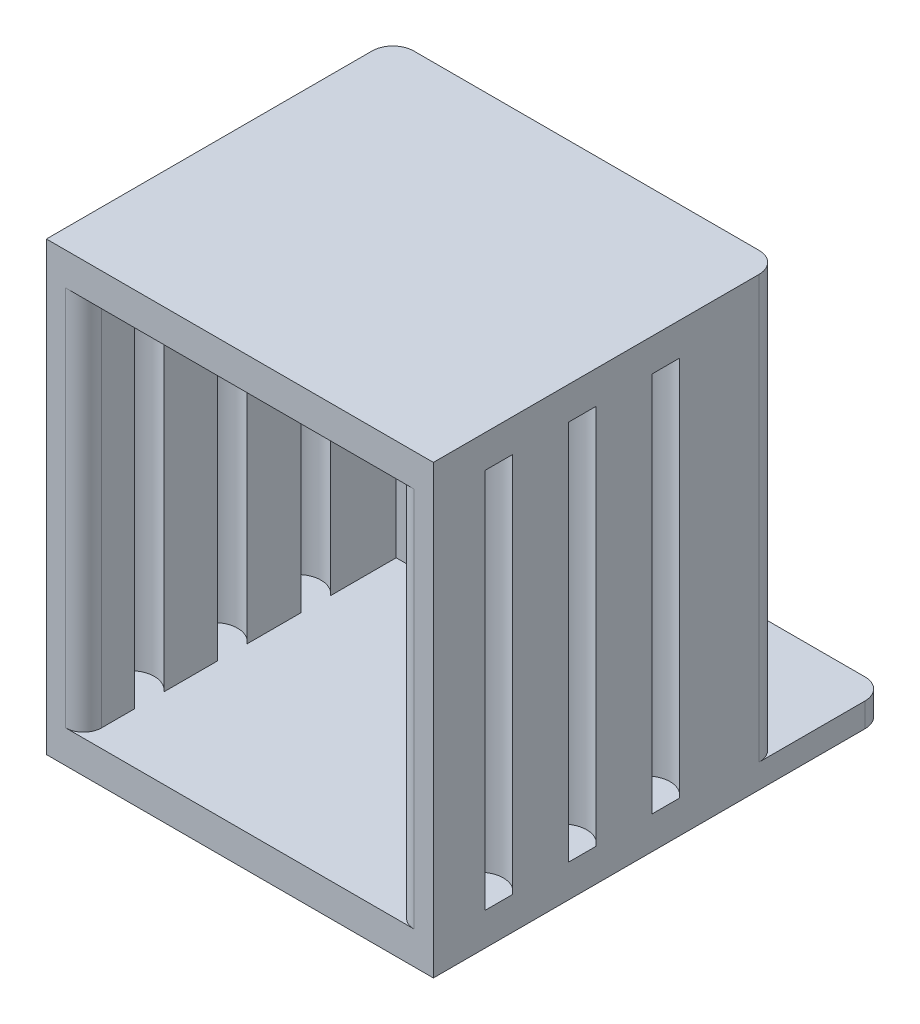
ISO-10303-21;
HEADER;
FILE_DESCRIPTION(('STEP AP214'),'2;1');
FILE_NAME('part.step','',(''),(''),'','','');
FILE_SCHEMA(('AUTOMOTIVE_DESIGN { 1 0 10303 214 1 1 1 1 }'));
ENDSEC;
DATA;
#1=APPLICATION_CONTEXT('core data for automotive mechanical design processes');
#2=APPLICATION_PROTOCOL_DEFINITION('international standard','automotive_design',2000,#1);
#3=PRODUCT_CONTEXT('',#1,'mechanical');
#4=PRODUCT('Part','Part','',(#3));
#5=PRODUCT_RELATED_PRODUCT_CATEGORY('part','',(#4));
#6=PRODUCT_DEFINITION_FORMATION('','',#4);
#7=PRODUCT_DEFINITION_CONTEXT('part definition',#1,'design');
#8=PRODUCT_DEFINITION('design','',#6,#7);
#9=PRODUCT_DEFINITION_SHAPE('','',#8);
#10=(LENGTH_UNIT() NAMED_UNIT(*) SI_UNIT(.MILLI.,.METRE.));
#11=(NAMED_UNIT(*) PLANE_ANGLE_UNIT() SI_UNIT($,.RADIAN.));
#12=(NAMED_UNIT(*) SI_UNIT($,.STERADIAN.) SOLID_ANGLE_UNIT());
#13=UNCERTAINTY_MEASURE_WITH_UNIT(LENGTH_MEASURE(1.E-05),#10,'distance_accuracy_value','');
#14=(GEOMETRIC_REPRESENTATION_CONTEXT(3) GLOBAL_UNCERTAINTY_ASSIGNED_CONTEXT((#13)) GLOBAL_UNIT_ASSIGNED_CONTEXT((#10,
#11,#12)) REPRESENTATION_CONTEXT('',''));
#15=CARTESIAN_POINT('',(0.,0.,0.));
#16=DIRECTION('',(0.,0.,1.));
#17=DIRECTION('',(1.,0.,0.));
#18=AXIS2_PLACEMENT_3D('',#15,#16,#17);
#19=CARTESIAN_POINT('',(-16.51,38.1,0.));
#20=DIRECTION('',(1.,0.,0.));
#21=DIRECTION('',(0.,0.,-1.));
#22=AXIS2_PLACEMENT_3D('',#19,#20,#21);
#23=PLANE('',#22);
#24=DIRECTION('',(0.,0.,1.));
#25=VECTOR('',#24,1.);
#26=CARTESIAN_POINT('',(-16.51,2.794,0.));
#27=LINE('',#26,#25);
#28=CARTESIAN_POINT('',(-16.51,2.794,-13.8743208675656));
#29=VERTEX_POINT('',#28);
#30=CARTESIAN_POINT('',(-16.51,2.794,-11.5256791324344));
#31=VERTEX_POINT('',#30);
#32=EDGE_CURVE('E339',#29,#31,#27,.T.);
#33=ORIENTED_EDGE('',*,*,#32,.F.);
#34=DIRECTION('',(0.,1.,0.));
#35=VECTOR('',#34,1.);
#36=CARTESIAN_POINT('',(-16.51,2.794,-13.8743208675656));
#37=LINE('',#36,#35);
#38=CARTESIAN_POINT('',(-16.51,35.306,-13.8743208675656));
#39=VERTEX_POINT('',#38);
#40=EDGE_CURVE('E334',#39,#29,#37,.F.);
#41=ORIENTED_EDGE('',*,*,#40,.F.);
#42=DIRECTION('',(0.,0.,1.));
#43=VECTOR('',#42,1.);
#44=CARTESIAN_POINT('',(-16.51,35.306,0.));
#45=LINE('',#44,#43);
#46=CARTESIAN_POINT('',(-16.51,35.306,-11.5256791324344));
#47=VERTEX_POINT('',#46);
#48=EDGE_CURVE('E336',#39,#47,#45,.T.);
#49=ORIENTED_EDGE('',*,*,#48,.T.);
#50=DIRECTION('',(0.,1.,0.));
#51=VECTOR('',#50,1.);
#52=CARTESIAN_POINT('',(-16.51,2.794,-11.5256791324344));
#53=LINE('',#52,#51);
#54=EDGE_CURVE('E331',#31,#47,#53,.T.);
#55=ORIENTED_EDGE('',*,*,#54,.F.);
#56=EDGE_LOOP('',(#33,#41,#49,#55));
#57=FACE_BOUND('',#56,.T.);
#58=DIRECTION('',(0.,0.,-1.));
#59=VECTOR('',#58,1.);
#60=CARTESIAN_POINT('',(-16.51,2.0574,-38.608));
#61=LINE('',#60,#59);
#62=CARTESIAN_POINT('',(-16.51,2.0574,-27.7876));
#63=VERTEX_POINT('',#62);
#64=CARTESIAN_POINT('',(-16.51,2.0574,-36.83));
#65=VERTEX_POINT('',#64);
#66=EDGE_CURVE('E443',#63,#65,#61,.T.);
#67=ORIENTED_EDGE('',*,*,#66,.T.);
#68=DIRECTION('',(0.,-1.,0.));
#69=VECTOR('',#68,1.);
#70=CARTESIAN_POINT('',(-16.51,0.,-36.83));
#71=LINE('',#70,#69);
#72=CARTESIAN_POINT('',(-16.51,0.,-36.83));
#73=VERTEX_POINT('',#72);
#74=EDGE_CURVE('E471',#65,#73,#71,.T.);
#75=ORIENTED_EDGE('',*,*,#74,.T.);
#76=DIRECTION('',(0.,0.,1.));
#77=VECTOR('',#76,1.);
#78=CARTESIAN_POINT('',(-16.51,0.,0.));
#79=LINE('',#78,#77);
#80=CARTESIAN_POINT('',(-16.51,0.,0.));
#81=VERTEX_POINT('',#80);
#82=EDGE_CURVE('E505',#73,#81,#79,.T.);
#83=ORIENTED_EDGE('',*,*,#82,.T.);
#84=DIRECTION('',(0.,-1.,0.));
#85=VECTOR('',#84,1.);
#86=CARTESIAN_POINT('',(-16.51,38.1,0.));
#87=LINE('',#86,#85);
#88=CARTESIAN_POINT('',(-16.51,38.1,0.));
#89=VERTEX_POINT('',#88);
#90=EDGE_CURVE('E492',#89,#81,#87,.T.);
#91=ORIENTED_EDGE('',*,*,#90,.F.);
#92=DIRECTION('',(0.,0.,1.));
#93=VECTOR('',#92,1.);
#94=CARTESIAN_POINT('',(-16.51,38.1,0.));
#95=LINE('',#94,#93);
#96=CARTESIAN_POINT('',(-16.51,38.1,-27.7876));
#97=VERTEX_POINT('',#96);
#98=EDGE_CURVE('E502',#97,#89,#95,.T.);
#99=ORIENTED_EDGE('',*,*,#98,.F.);
#100=DIRECTION('',(0.,-1.,0.));
#101=VECTOR('',#100,1.);
#102=CARTESIAN_POINT('',(-16.51,38.1,-27.7876));
#103=LINE('',#102,#101);
#104=EDGE_CURVE('E453',#97,#63,#103,.T.);
#105=ORIENTED_EDGE('',*,*,#104,.T.);
#106=EDGE_LOOP('',(#67,#75,#83,#91,#99,#105));
#107=FACE_BOUND('',#106,.T.);
#108=DIRECTION('',(0.,0.,1.));
#109=VECTOR('',#108,1.);
#110=CARTESIAN_POINT('',(-16.51,2.794,0.));
#111=LINE('',#110,#109);
#112=CARTESIAN_POINT('',(-16.51,2.794,-6.7623208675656));
#113=VERTEX_POINT('',#112);
#114=CARTESIAN_POINT('',(-16.51,2.794,-4.4136791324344));
#115=VERTEX_POINT('',#114);
#116=EDGE_CURVE('E361',#113,#115,#111,.T.);
#117=ORIENTED_EDGE('',*,*,#116,.F.);
#118=DIRECTION('',(0.,1.,0.));
#119=VECTOR('',#118,1.);
#120=CARTESIAN_POINT('',(-16.51,2.794,-6.7623208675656));
#121=LINE('',#120,#119);
#122=CARTESIAN_POINT('',(-16.51,35.306,-6.7623208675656));
#123=VERTEX_POINT('',#122);
#124=EDGE_CURVE('E356',#123,#113,#121,.F.);
#125=ORIENTED_EDGE('',*,*,#124,.F.);
#126=DIRECTION('',(0.,0.,1.));
#127=VECTOR('',#126,1.);
#128=CARTESIAN_POINT('',(-16.51,35.306,0.));
#129=LINE('',#128,#127);
#130=CARTESIAN_POINT('',(-16.51,35.306,-4.4136791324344));
#131=VERTEX_POINT('',#130);
#132=EDGE_CURVE('E358',#123,#131,#129,.T.);
#133=ORIENTED_EDGE('',*,*,#132,.T.);
#134=DIRECTION('',(0.,1.,0.));
#135=VECTOR('',#134,1.);
#136=CARTESIAN_POINT('',(-16.51,2.794,-4.4136791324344));
#137=LINE('',#136,#135);
#138=EDGE_CURVE('E353',#115,#131,#137,.T.);
#139=ORIENTED_EDGE('',*,*,#138,.F.);
#140=EDGE_LOOP('',(#117,#125,#133,#139));
#141=FACE_BOUND('',#140,.T.);
#142=DIRECTION('',(0.,0.,1.));
#143=VECTOR('',#142,1.);
#144=CARTESIAN_POINT('',(-16.51,2.794,0.));
#145=LINE('',#144,#143);
#146=CARTESIAN_POINT('',(-16.51,2.794,-20.9863208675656));
#147=VERTEX_POINT('',#146);
#148=CARTESIAN_POINT('',(-16.51,2.794,-18.6376791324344));
#149=VERTEX_POINT('',#148);
#150=EDGE_CURVE('E290',#147,#149,#145,.T.);
#151=ORIENTED_EDGE('',*,*,#150,.F.);
#152=DIRECTION('',(0.,1.,0.));
#153=VECTOR('',#152,1.);
#154=CARTESIAN_POINT('',(-16.51,2.794,-20.9863208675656));
#155=LINE('',#154,#153);
#156=CARTESIAN_POINT('',(-16.51,35.306,-20.9863208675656));
#157=VERTEX_POINT('',#156);
#158=EDGE_CURVE('E312',#157,#147,#155,.F.);
#159=ORIENTED_EDGE('',*,*,#158,.F.);
#160=DIRECTION('',(0.,0.,1.));
#161=VECTOR('',#160,1.);
#162=CARTESIAN_POINT('',(-16.51,35.306,0.));
#163=LINE('',#162,#161);
#164=CARTESIAN_POINT('',(-16.51,35.306,-18.6376791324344));
#165=VERTEX_POINT('',#164);
#166=EDGE_CURVE('E301',#157,#165,#163,.T.);
#167=ORIENTED_EDGE('',*,*,#166,.T.);
#168=DIRECTION('',(0.,1.,0.));
#169=VECTOR('',#168,1.);
#170=CARTESIAN_POINT('',(-16.51,2.794,-18.6376791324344));
#171=LINE('',#170,#169);
#172=EDGE_CURVE('E306',#149,#165,#171,.T.);
#173=ORIENTED_EDGE('',*,*,#172,.F.);
#174=EDGE_LOOP('',(#151,#159,#167,#173));
#175=FACE_BOUND('',#174,.T.);
#176=ADVANCED_FACE('F32',(#57,#107,#141,#175),#23,.F.);
#177=CARTESIAN_POINT('',(-13.335,2.794,-26.67));
#178=DIRECTION('',(-1.,0.,0.));
#179=DIRECTION('',(0.,0.,1.));
#180=AXIS2_PLACEMENT_3D('',#177,#178,#179);
#181=PLANE('',#180);
#182=DIRECTION('',(0.,1.,0.));
#183=VECTOR('',#182,1.);
#184=CARTESIAN_POINT('',(-13.335,2.794,-18.5547641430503));
#185=LINE('',#184,#183);
#186=CARTESIAN_POINT('',(-13.335,35.306,-18.5547641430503));
#187=VERTEX_POINT('',#186);
#188=CARTESIAN_POINT('',(-13.335,2.794,-18.5547641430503));
#189=VERTEX_POINT('',#188);
#190=EDGE_CURVE('E309',#187,#189,#185,.F.);
#191=ORIENTED_EDGE('',*,*,#190,.F.);
#192=DIRECTION('',(0.,0.,1.));
#193=VECTOR('',#192,1.);
#194=CARTESIAN_POINT('',(-13.335,35.306,-26.67));
#195=LINE('',#194,#193);
#196=CARTESIAN_POINT('',(-13.335,35.306,-13.9572358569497));
#197=VERTEX_POINT('',#196);
#198=EDGE_CURVE('E533',#187,#197,#195,.T.);
#199=ORIENTED_EDGE('',*,*,#198,.T.);
#200=DIRECTION('',(0.,1.,0.));
#201=VECTOR('',#200,1.);
#202=CARTESIAN_POINT('',(-13.335,2.794,-13.9572358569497));
#203=LINE('',#202,#201);
#204=CARTESIAN_POINT('',(-13.335,2.794,-13.9572358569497));
#205=VERTEX_POINT('',#204);
#206=EDGE_CURVE('E326',#205,#197,#203,.T.);
#207=ORIENTED_EDGE('',*,*,#206,.F.);
#208=DIRECTION('',(0.,0.,1.));
#209=VECTOR('',#208,1.);
#210=CARTESIAN_POINT('',(-13.335,2.794,-26.67));
#211=LINE('',#210,#209);
#212=EDGE_CURVE('E519',#189,#205,#211,.T.);
#213=ORIENTED_EDGE('',*,*,#212,.F.);
#214=EDGE_LOOP('',(#191,#199,#207,#213));
#215=FACE_BOUND('',#214,.T.);
#216=ADVANCED_FACE('F570',(#215),#181,.F.);
#217=DIRECTION('',(0.,1.,0.));
#218=VECTOR('',#217,1.);
#219=CARTESIAN_POINT('',(-13.335,2.794,-21.0692358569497));
#220=LINE('',#219,#218);
#221=CARTESIAN_POINT('',(-13.335,2.794,-21.0692358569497));
#222=VERTEX_POINT('',#221);
#223=CARTESIAN_POINT('',(-13.335,35.306,-21.0692358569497));
#224=VERTEX_POINT('',#223);
#225=EDGE_CURVE('E315',#222,#224,#220,.T.);
#226=ORIENTED_EDGE('',*,*,#225,.F.);
#227=CARTESIAN_POINT('',(-13.335,2.794,-26.67));
#228=VERTEX_POINT('',#227);
#229=EDGE_CURVE('E516',#228,#222,#211,.T.);
#230=ORIENTED_EDGE('',*,*,#229,.F.);
#231=DIRECTION('',(0.,-1.,0.));
#232=VECTOR('',#231,1.);
#233=CARTESIAN_POINT('',(-13.335,2.794,-26.67));
#234=LINE('',#233,#232);
#235=CARTESIAN_POINT('',(-13.335,35.306,-26.67));
#236=VERTEX_POINT('',#235);
#237=EDGE_CURVE('E536',#236,#228,#234,.T.);
#238=ORIENTED_EDGE('',*,*,#237,.F.);
#239=EDGE_CURVE('E507',#236,#224,#195,.T.);
#240=ORIENTED_EDGE('',*,*,#239,.T.);
#241=EDGE_LOOP('',(#226,#230,#238,#240));
#242=FACE_BOUND('',#241,.T.);
#243=ADVANCED_FACE('F554',(#242),#181,.F.);
#244=DIRECTION('',(0.,1.,0.));
#245=VECTOR('',#244,1.);
#246=CARTESIAN_POINT('',(-13.335,2.794,-11.4427641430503));
#247=LINE('',#246,#245);
#248=CARTESIAN_POINT('',(-13.335,35.306,-11.4427641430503));
#249=VERTEX_POINT('',#248);
#250=CARTESIAN_POINT('',(-13.335,2.794,-11.4427641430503));
#251=VERTEX_POINT('',#250);
#252=EDGE_CURVE('E329',#249,#251,#247,.F.);
#253=ORIENTED_EDGE('',*,*,#252,.F.);
#254=CARTESIAN_POINT('',(-13.335,35.306,-6.84523585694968));
#255=VERTEX_POINT('',#254);
#256=EDGE_CURVE('E1031',#249,#255,#195,.T.);
#257=ORIENTED_EDGE('',*,*,#256,.T.);
#258=DIRECTION('',(0.,1.,0.));
#259=VECTOR('',#258,1.);
#260=CARTESIAN_POINT('',(-13.335,2.794,-6.84523585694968));
#261=LINE('',#260,#259);
#262=CARTESIAN_POINT('',(-13.335,2.794,-6.84523585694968));
#263=VERTEX_POINT('',#262);
#264=EDGE_CURVE('E348',#263,#255,#261,.T.);
#265=ORIENTED_EDGE('',*,*,#264,.F.);
#266=EDGE_CURVE('E574',#251,#263,#211,.T.);
#267=ORIENTED_EDGE('',*,*,#266,.F.);
#268=EDGE_LOOP('',(#253,#257,#265,#267));
#269=FACE_BOUND('',#268,.T.);
#270=ADVANCED_FACE('F717',(#269),#181,.F.);
#271=CARTESIAN_POINT('',(-13.335,35.306,-4.33076414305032));
#272=VERTEX_POINT('',#271);
#273=CARTESIAN_POINT('',(-13.335,35.306,-1.524));
#274=VERTEX_POINT('',#273);
#275=EDGE_CURVE('E529',#272,#274,#195,.T.);
#276=ORIENTED_EDGE('',*,*,#275,.T.);
#277=DIRECTION('',(0.,-1.,0.));
#278=VECTOR('',#277,1.);
#279=CARTESIAN_POINT('',(-13.335,2.794,-1.524));
#280=LINE('',#279,#278);
#281=CARTESIAN_POINT('',(-13.335,2.794,-1.524));
#282=VERTEX_POINT('',#281);
#283=EDGE_CURVE('E585',#274,#282,#280,.T.);
#284=ORIENTED_EDGE('',*,*,#283,.T.);
#285=CARTESIAN_POINT('',(-13.335,2.794,-4.33076414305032));
#286=VERTEX_POINT('',#285);
#287=EDGE_CURVE('E520',#286,#282,#211,.T.);
#288=ORIENTED_EDGE('',*,*,#287,.F.);
#289=DIRECTION('',(0.,1.,0.));
#290=VECTOR('',#289,1.);
#291=CARTESIAN_POINT('',(-13.335,2.794,-4.33076414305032));
#292=LINE('',#291,#290);
#293=EDGE_CURVE('E351',#272,#286,#292,.F.);
#294=ORIENTED_EDGE('',*,*,#293,.F.);
#295=EDGE_LOOP('',(#276,#284,#288,#294));
#296=FACE_BOUND('',#295,.T.);
#297=ADVANCED_FACE('F584',(#296),#181,.F.);
#298=CARTESIAN_POINT('',(16.51,38.1,0.));
#299=DIRECTION('',(-1.,0.,0.));
#300=DIRECTION('',(0.,0.,1.));
#301=AXIS2_PLACEMENT_3D('',#298,#299,#300);
#302=PLANE('',#301);
#303=DIRECTION('',(0.,0.,-1.));
#304=VECTOR('',#303,1.);
#305=CARTESIAN_POINT('',(16.51,2.794,0.));
#306=LINE('',#305,#304);
#307=CARTESIAN_POINT('',(16.51,2.794,-11.5256791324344));
#308=VERTEX_POINT('',#307);
#309=CARTESIAN_POINT('',(16.51,2.794,-13.8743208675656));
#310=VERTEX_POINT('',#309);
#311=EDGE_CURVE('E411',#308,#310,#306,.T.);
#312=ORIENTED_EDGE('',*,*,#311,.F.);
#313=DIRECTION('',(0.,1.,0.));
#314=VECTOR('',#313,1.);
#315=CARTESIAN_POINT('',(16.51,2.794,-11.5256791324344));
#316=LINE('',#315,#314);
#317=CARTESIAN_POINT('',(16.51,35.306,-11.5256791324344));
#318=VERTEX_POINT('',#317);
#319=EDGE_CURVE('E405',#308,#318,#316,.T.);
#320=ORIENTED_EDGE('',*,*,#319,.T.);
#321=DIRECTION('',(0.,0.,-1.));
#322=VECTOR('',#321,1.);
#323=CARTESIAN_POINT('',(16.51,35.306,0.));
#324=LINE('',#323,#322);
#325=CARTESIAN_POINT('',(16.51,35.306,-13.8743208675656));
#326=VERTEX_POINT('',#325);
#327=EDGE_CURVE('E408',#318,#326,#324,.T.);
#328=ORIENTED_EDGE('',*,*,#327,.T.);
#329=DIRECTION('',(0.,1.,0.));
#330=VECTOR('',#329,1.);
#331=CARTESIAN_POINT('',(16.51,2.794,-13.8743208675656));
#332=LINE('',#331,#330);
#333=EDGE_CURVE('E402',#326,#310,#332,.F.);
#334=ORIENTED_EDGE('',*,*,#333,.T.);
#335=EDGE_LOOP('',(#312,#320,#328,#334));
#336=FACE_BOUND('',#335,.T.);
#337=DIRECTION('',(0.,0.,-1.));
#338=VECTOR('',#337,1.);
#339=CARTESIAN_POINT('',(16.51,0.,0.));
#340=LINE('',#339,#338);
#341=CARTESIAN_POINT('',(16.51,0.,0.));
#342=VERTEX_POINT('',#341);
#343=CARTESIAN_POINT('',(16.51,0.,-36.83));
#344=VERTEX_POINT('',#343);
#345=EDGE_CURVE('E499',#342,#344,#340,.T.);
#346=ORIENTED_EDGE('',*,*,#345,.T.);
#347=DIRECTION('',(0.,-1.,0.));
#348=VECTOR('',#347,1.);
#349=CARTESIAN_POINT('',(16.51,2.0574,-36.83));
#350=LINE('',#349,#348);
#351=CARTESIAN_POINT('',(16.51,2.0574,-36.83));
#352=VERTEX_POINT('',#351);
#353=EDGE_CURVE('E612',#344,#352,#350,.F.);
#354=ORIENTED_EDGE('',*,*,#353,.T.);
#355=DIRECTION('',(0.,0.,1.));
#356=VECTOR('',#355,1.);
#357=CARTESIAN_POINT('',(16.51,2.0574,-38.608));
#358=LINE('',#357,#356);
#359=CARTESIAN_POINT('',(16.51,2.0574,-27.7876));
#360=VERTEX_POINT('',#359);
#361=EDGE_CURVE('E442',#352,#360,#358,.T.);
#362=ORIENTED_EDGE('',*,*,#361,.T.);
#363=DIRECTION('',(0.,-1.,0.));
#364=VECTOR('',#363,1.);
#365=CARTESIAN_POINT('',(16.51,38.1,-27.7876));
#366=LINE('',#365,#364);
#367=CARTESIAN_POINT('',(16.51,38.1,-27.7876));
#368=VERTEX_POINT('',#367);
#369=EDGE_CURVE('E464',#360,#368,#366,.F.);
#370=ORIENTED_EDGE('',*,*,#369,.T.);
#371=DIRECTION('',(0.,0.,-1.));
#372=VECTOR('',#371,1.);
#373=CARTESIAN_POINT('',(16.51,38.1,0.));
#374=LINE('',#373,#372);
#375=CARTESIAN_POINT('',(16.51,38.1,0.));
#376=VERTEX_POINT('',#375);
#377=EDGE_CURVE('E510',#376,#368,#374,.T.);
#378=ORIENTED_EDGE('',*,*,#377,.F.);
#379=DIRECTION('',(0.,-1.,0.));
#380=VECTOR('',#379,1.);
#381=CARTESIAN_POINT('',(16.51,38.1,0.));
#382=LINE('',#381,#380);
#383=EDGE_CURVE('E495',#376,#342,#382,.T.);
#384=ORIENTED_EDGE('',*,*,#383,.T.);
#385=EDGE_LOOP('',(#346,#354,#362,#370,#378,#384));
#386=FACE_BOUND('',#385,.T.);
#387=DIRECTION('',(0.,0.,-1.));
#388=VECTOR('',#387,1.);
#389=CARTESIAN_POINT('',(16.51,2.794,0.));
#390=LINE('',#389,#388);
#391=CARTESIAN_POINT('',(16.51,2.794,-4.4136791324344));
#392=VERTEX_POINT('',#391);
#393=CARTESIAN_POINT('',(16.51,2.794,-6.7623208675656));
#394=VERTEX_POINT('',#393);
#395=EDGE_CURVE('E436',#392,#394,#390,.T.);
#396=ORIENTED_EDGE('',*,*,#395,.F.);
#397=DIRECTION('',(0.,1.,0.));
#398=VECTOR('',#397,1.);
#399=CARTESIAN_POINT('',(16.51,2.794,-4.4136791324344));
#400=LINE('',#399,#398);
#401=CARTESIAN_POINT('',(16.51,35.306,-4.4136791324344));
#402=VERTEX_POINT('',#401);
#403=EDGE_CURVE('E430',#392,#402,#400,.T.);
#404=ORIENTED_EDGE('',*,*,#403,.T.);
#405=DIRECTION('',(0.,0.,-1.));
#406=VECTOR('',#405,1.);
#407=CARTESIAN_POINT('',(16.51,35.306,0.));
#408=LINE('',#407,#406);
#409=CARTESIAN_POINT('',(16.51,35.306,-6.7623208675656));
#410=VERTEX_POINT('',#409);
#411=EDGE_CURVE('E433',#402,#410,#408,.T.);
#412=ORIENTED_EDGE('',*,*,#411,.T.);
#413=DIRECTION('',(0.,1.,0.));
#414=VECTOR('',#413,1.);
#415=CARTESIAN_POINT('',(16.51,2.794,-6.7623208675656));
#416=LINE('',#415,#414);
#417=EDGE_CURVE('E427',#410,#394,#416,.F.);
#418=ORIENTED_EDGE('',*,*,#417,.T.);
#419=EDGE_LOOP('',(#396,#404,#412,#418));
#420=FACE_BOUND('',#419,.T.);
#421=DIRECTION('',(0.,0.,-1.));
#422=VECTOR('',#421,1.);
#423=CARTESIAN_POINT('',(16.51,2.794,0.));
#424=LINE('',#423,#422);
#425=CARTESIAN_POINT('',(16.51,2.794,-18.6376791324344));
#426=VERTEX_POINT('',#425);
#427=CARTESIAN_POINT('',(16.51,2.794,-20.9863208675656));
#428=VERTEX_POINT('',#427);
#429=EDGE_CURVE('E386',#426,#428,#424,.T.);
#430=ORIENTED_EDGE('',*,*,#429,.F.);
#431=DIRECTION('',(0.,1.,0.));
#432=VECTOR('',#431,1.);
#433=CARTESIAN_POINT('',(16.51,2.794,-18.6376791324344));
#434=LINE('',#433,#432);
#435=CARTESIAN_POINT('',(16.51,35.306,-18.6376791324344));
#436=VERTEX_POINT('',#435);
#437=EDGE_CURVE('E380',#426,#436,#434,.T.);
#438=ORIENTED_EDGE('',*,*,#437,.T.);
#439=DIRECTION('',(0.,0.,-1.));
#440=VECTOR('',#439,1.);
#441=CARTESIAN_POINT('',(16.51,35.306,0.));
#442=LINE('',#441,#440);
#443=CARTESIAN_POINT('',(16.51,35.306,-20.9863208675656));
#444=VERTEX_POINT('',#443);
#445=EDGE_CURVE('E383',#436,#444,#442,.T.);
#446=ORIENTED_EDGE('',*,*,#445,.T.);
#447=DIRECTION('',(0.,1.,0.));
#448=VECTOR('',#447,1.);
#449=CARTESIAN_POINT('',(16.51,2.794,-20.9863208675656));
#450=LINE('',#449,#448);
#451=EDGE_CURVE('E377',#444,#428,#450,.F.);
#452=ORIENTED_EDGE('',*,*,#451,.T.);
#453=EDGE_LOOP('',(#430,#438,#446,#452));
#454=FACE_BOUND('',#453,.T.);
#455=ADVANCED_FACE('F638',(#336,#386,#420,#454),#302,.F.);
#456=CARTESIAN_POINT('',(13.335,2.794,-26.67));
#457=DIRECTION('',(1.,0.,0.));
#458=DIRECTION('',(0.,0.,-1.));
#459=AXIS2_PLACEMENT_3D('',#456,#457,#458);
#460=PLANE('',#459);
#461=DIRECTION('',(0.,0.,1.));
#462=VECTOR('',#461,1.);
#463=CARTESIAN_POINT('',(13.335,2.794,-26.67));
#464=LINE('',#463,#462);
#465=CARTESIAN_POINT('',(13.335,2.794,-26.67));
#466=VERTEX_POINT('',#465);
#467=CARTESIAN_POINT('',(13.335,2.794,-21.0692358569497));
#468=VERTEX_POINT('',#467);
#469=EDGE_CURVE('E521',#466,#468,#464,.T.);
#470=ORIENTED_EDGE('',*,*,#469,.T.);
#471=DIRECTION('',(0.,1.,0.));
#472=VECTOR('',#471,1.);
#473=CARTESIAN_POINT('',(13.335,2.794,-21.0692358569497));
#474=LINE('',#473,#472);
#475=CARTESIAN_POINT('',(13.335,35.306,-21.0692358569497));
#476=VERTEX_POINT('',#475);
#477=EDGE_CURVE('E374',#468,#476,#474,.T.);
#478=ORIENTED_EDGE('',*,*,#477,.T.);
#479=DIRECTION('',(0.,0.,1.));
#480=VECTOR('',#479,1.);
#481=CARTESIAN_POINT('',(13.335,35.306,-26.67));
#482=LINE('',#481,#480);
#483=CARTESIAN_POINT('',(13.335,35.306,-26.67));
#484=VERTEX_POINT('',#483);
#485=EDGE_CURVE('E526',#484,#476,#482,.T.);
#486=ORIENTED_EDGE('',*,*,#485,.F.);
#487=DIRECTION('',(0.,1.,0.));
#488=VECTOR('',#487,1.);
#489=CARTESIAN_POINT('',(13.335,2.794,-26.67));
#490=LINE('',#489,#488);
#491=EDGE_CURVE('E541',#466,#484,#490,.T.);
#492=ORIENTED_EDGE('',*,*,#491,.F.);
#493=EDGE_LOOP('',(#470,#478,#486,#492));
#494=FACE_BOUND('',#493,.T.);
#495=ADVANCED_FACE('F560',(#494),#460,.F.);
#496=CARTESIAN_POINT('',(13.335,35.306,-18.5547641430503));
#497=VERTEX_POINT('',#496);
#498=CARTESIAN_POINT('',(13.335,35.306,-13.9572358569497));
#499=VERTEX_POINT('',#498);
#500=EDGE_CURVE('E530',#497,#499,#482,.T.);
#501=ORIENTED_EDGE('',*,*,#500,.F.);
#502=DIRECTION('',(0.,1.,0.));
#503=VECTOR('',#502,1.);
#504=CARTESIAN_POINT('',(13.335,2.794,-18.5547641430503));
#505=LINE('',#504,#503);
#506=CARTESIAN_POINT('',(13.335,2.794,-18.5547641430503));
#507=VERTEX_POINT('',#506);
#508=EDGE_CURVE('E371',#497,#507,#505,.F.);
#509=ORIENTED_EDGE('',*,*,#508,.T.);
#510=CARTESIAN_POINT('',(13.335,2.794,-13.9572358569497));
#511=VERTEX_POINT('',#510);
#512=EDGE_CURVE('E525',#507,#511,#464,.T.);
#513=ORIENTED_EDGE('',*,*,#512,.T.);
#514=DIRECTION('',(0.,1.,0.));
#515=VECTOR('',#514,1.);
#516=CARTESIAN_POINT('',(13.335,2.794,-13.9572358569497));
#517=LINE('',#516,#515);
#518=EDGE_CURVE('E399',#511,#499,#517,.T.);
#519=ORIENTED_EDGE('',*,*,#518,.T.);
#520=EDGE_LOOP('',(#501,#509,#513,#519));
#521=FACE_BOUND('',#520,.T.);
#522=ADVANCED_FACE('F715',(#521),#460,.F.);
#523=CARTESIAN_POINT('',(13.335,35.306,-11.4427641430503));
#524=VERTEX_POINT('',#523);
#525=CARTESIAN_POINT('',(13.335,35.306,-6.84523585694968));
#526=VERTEX_POINT('',#525);
#527=EDGE_CURVE('E742',#524,#526,#482,.T.);
#528=ORIENTED_EDGE('',*,*,#527,.F.);
#529=DIRECTION('',(0.,1.,0.));
#530=VECTOR('',#529,1.);
#531=CARTESIAN_POINT('',(13.335,2.794,-11.4427641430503));
#532=LINE('',#531,#530);
#533=CARTESIAN_POINT('',(13.335,2.794,-11.4427641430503));
#534=VERTEX_POINT('',#533);
#535=EDGE_CURVE('E396',#524,#534,#532,.F.);
#536=ORIENTED_EDGE('',*,*,#535,.T.);
#537=CARTESIAN_POINT('',(13.335,2.794,-6.84523585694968));
#538=VERTEX_POINT('',#537);
#539=EDGE_CURVE('E610',#534,#538,#464,.T.);
#540=ORIENTED_EDGE('',*,*,#539,.T.);
#541=DIRECTION('',(0.,1.,0.));
#542=VECTOR('',#541,1.);
#543=CARTESIAN_POINT('',(13.335,2.794,-6.84523585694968));
#544=LINE('',#543,#542);
#545=EDGE_CURVE('E424',#538,#526,#544,.T.);
#546=ORIENTED_EDGE('',*,*,#545,.T.);
#547=EDGE_LOOP('',(#528,#536,#540,#546));
#548=FACE_BOUND('',#547,.T.);
#549=ADVANCED_FACE('F706',(#548),#460,.F.);
#550=CARTESIAN_POINT('',(-16.51,38.1,0.));
#551=DIRECTION('',(0.,0.,-1.));
#552=DIRECTION('',(-1.,0.,0.));
#553=AXIS2_PLACEMENT_3D('',#550,#551,#552);
#554=PLANE('',#553);
#555=DIRECTION('',(-1.,0.,0.));
#556=VECTOR('',#555,1.);
#557=CARTESIAN_POINT('',(-13.335,35.306,0.));
#558=LINE('',#557,#556);
#559=CARTESIAN_POINT('',(14.859,35.306,0.));
#560=VERTEX_POINT('',#559);
#561=CARTESIAN_POINT('',(-14.859,35.306,0.));
#562=VERTEX_POINT('',#561);
#563=EDGE_CURVE('E534',#560,#562,#558,.T.);
#564=ORIENTED_EDGE('',*,*,#563,.F.);
#565=DIRECTION('',(0.,1.,0.));
#566=VECTOR('',#565,1.);
#567=CARTESIAN_POINT('',(14.859,38.1,0.));
#568=LINE('',#567,#566);
#569=CARTESIAN_POINT('',(14.859,2.794,0.));
#570=VERTEX_POINT('',#569);
#571=EDGE_CURVE('E587',#560,#570,#568,.F.);
#572=ORIENTED_EDGE('',*,*,#571,.T.);
#573=DIRECTION('',(1.,0.,0.));
#574=VECTOR('',#573,1.);
#575=CARTESIAN_POINT('',(-13.335,2.794,0.));
#576=LINE('',#575,#574);
#577=CARTESIAN_POINT('',(-14.859,2.794,0.));
#578=VERTEX_POINT('',#577);
#579=EDGE_CURVE('E452',#578,#570,#576,.T.);
#580=ORIENTED_EDGE('',*,*,#579,.F.);
#581=DIRECTION('',(0.,-1.,0.));
#582=VECTOR('',#581,1.);
#583=CARTESIAN_POINT('',(-14.859,38.1,0.));
#584=LINE('',#583,#582);
#585=EDGE_CURVE('E593',#578,#562,#584,.F.);
#586=ORIENTED_EDGE('',*,*,#585,.T.);
#587=EDGE_LOOP('',(#564,#572,#580,#586));
#588=FACE_BOUND('',#587,.T.);
#589=DIRECTION('',(1.,0.,0.));
#590=VECTOR('',#589,1.);
#591=CARTESIAN_POINT('',(-16.51,0.,0.));
#592=LINE('',#591,#590);
#593=EDGE_CURVE('E503',#81,#342,#592,.T.);
#594=ORIENTED_EDGE('',*,*,#593,.T.);
#595=ORIENTED_EDGE('',*,*,#383,.F.);
#596=DIRECTION('',(1.,0.,0.));
#597=VECTOR('',#596,1.);
#598=CARTESIAN_POINT('',(-16.51,38.1,0.));
#599=LINE('',#598,#597);
#600=EDGE_CURVE('E513',#89,#376,#599,.T.);
#601=ORIENTED_EDGE('',*,*,#600,.F.);
#602=ORIENTED_EDGE('',*,*,#90,.T.);
#603=EDGE_LOOP('',(#594,#595,#601,#602));
#604=FACE_BOUND('',#603,.T.);
#605=ADVANCED_FACE('F644',(#588,#604),#554,.F.);
#606=CARTESIAN_POINT('',(-16.51,38.1,-29.5656));
#607=DIRECTION('',(0.,0.,1.));
#608=DIRECTION('',(1.,0.,0.));
#609=AXIS2_PLACEMENT_3D('',#606,#607,#608);
#610=PLANE('',#609);
#611=DIRECTION('',(-1.,0.,0.));
#612=VECTOR('',#611,1.);
#613=CARTESIAN_POINT('',(-16.51,2.0574,-29.5656));
#614=LINE('',#613,#612);
#615=CARTESIAN_POINT('',(14.732,2.0574,-29.5656));
#616=VERTEX_POINT('',#615);
#617=CARTESIAN_POINT('',(-14.732,2.0574,-29.5656));
#618=VERTEX_POINT('',#617);
#619=EDGE_CURVE('E448',#616,#618,#614,.T.);
#620=ORIENTED_EDGE('',*,*,#619,.T.);
#621=DIRECTION('',(0.,-1.,0.));
#622=VECTOR('',#621,1.);
#623=CARTESIAN_POINT('',(-14.732,38.1,-29.5656));
#624=LINE('',#623,#622);
#625=CARTESIAN_POINT('',(-14.732,38.1,-29.5656));
#626=VERTEX_POINT('',#625);
#627=EDGE_CURVE('E458',#618,#626,#624,.F.);
#628=ORIENTED_EDGE('',*,*,#627,.T.);
#629=DIRECTION('',(-1.,0.,0.));
#630=VECTOR('',#629,1.);
#631=CARTESIAN_POINT('',(-16.51,38.1,-29.5656));
#632=LINE('',#631,#630);
#633=CARTESIAN_POINT('',(14.732,38.1,-29.5656));
#634=VERTEX_POINT('',#633);
#635=EDGE_CURVE('E498',#634,#626,#632,.T.);
#636=ORIENTED_EDGE('',*,*,#635,.F.);
#637=DIRECTION('',(0.,-1.,0.));
#638=VECTOR('',#637,1.);
#639=CARTESIAN_POINT('',(14.732,38.1,-29.5656));
#640=LINE('',#639,#638);
#641=EDGE_CURVE('E455',#634,#616,#640,.T.);
#642=ORIENTED_EDGE('',*,*,#641,.T.);
#643=EDGE_LOOP('',(#620,#628,#636,#642));
#644=FACE_BOUND('',#643,.T.);
#645=ADVANCED_FACE('F694',(#644),#610,.F.);
#646=CARTESIAN_POINT('',(-16.51,38.1,-29.5656));
#647=DIRECTION('',(0.,-1.,0.));
#648=DIRECTION('',(0.,0.,-1.));
#649=AXIS2_PLACEMENT_3D('',#646,#647,#648);
#650=PLANE('',#649);
#651=ORIENTED_EDGE('',*,*,#635,.T.);
#652=CARTESIAN_POINT('',(-14.732,38.1,-27.7876));
#653=DIRECTION('',(0.,-1.,0.));
#654=DIRECTION('',(0.,0.,-1.));
#655=AXIS2_PLACEMENT_3D('',#652,#653,#654);
#656=CIRCLE('',#655,1.778);
#657=EDGE_CURVE('E462',#626,#97,#656,.F.);
#658=ORIENTED_EDGE('',*,*,#657,.T.);
#659=ORIENTED_EDGE('',*,*,#98,.T.);
#660=ORIENTED_EDGE('',*,*,#600,.T.);
#661=ORIENTED_EDGE('',*,*,#377,.T.);
#662=CARTESIAN_POINT('',(14.732,38.1,-27.7876));
#663=DIRECTION('',(0.,-1.,0.));
#664=DIRECTION('',(0.,0.,-1.));
#665=AXIS2_PLACEMENT_3D('',#662,#663,#664);
#666=CIRCLE('',#665,1.778);
#667=EDGE_CURVE('E460',#368,#634,#666,.F.);
#668=ORIENTED_EDGE('',*,*,#667,.T.);
#669=EDGE_LOOP('',(#651,#658,#659,#660,#661,#668));
#670=FACE_BOUND('',#669,.T.);
#671=ADVANCED_FACE('F691',(#670),#650,.F.);
#672=CARTESIAN_POINT('',(-16.51,0.,-29.5656));
#673=DIRECTION('',(0.,-1.,0.));
#674=DIRECTION('',(0.,0.,-1.));
#675=AXIS2_PLACEMENT_3D('',#672,#673,#674);
#676=PLANE('',#675);
#677=ORIENTED_EDGE('',*,*,#82,.F.);
#678=CARTESIAN_POINT('',(-14.732,0.,-36.83));
#679=DIRECTION('',(0.,-1.,0.));
#680=DIRECTION('',(0.,0.,-1.));
#681=AXIS2_PLACEMENT_3D('',#678,#679,#680);
#682=CIRCLE('',#681,1.778);
#683=CARTESIAN_POINT('',(-14.732,0.,-38.608));
#684=VERTEX_POINT('',#683);
#685=EDGE_CURVE('E476',#73,#684,#682,.T.);
#686=ORIENTED_EDGE('',*,*,#685,.T.);
#687=DIRECTION('',(1.,0.,0.));
#688=VECTOR('',#687,1.);
#689=CARTESIAN_POINT('',(-16.51,0.,-38.608));
#690=LINE('',#689,#688);
#691=CARTESIAN_POINT('',(14.732,0.,-38.608));
#692=VERTEX_POINT('',#691);
#693=EDGE_CURVE('E438',#684,#692,#690,.T.);
#694=ORIENTED_EDGE('',*,*,#693,.T.);
#695=CARTESIAN_POINT('',(14.732,0.,-36.83));
#696=DIRECTION('',(0.,-1.,0.));
#697=DIRECTION('',(0.,0.,-1.));
#698=AXIS2_PLACEMENT_3D('',#695,#696,#697);
#699=CIRCLE('',#698,1.778);
#700=EDGE_CURVE('E474',#692,#344,#699,.T.);
#701=ORIENTED_EDGE('',*,*,#700,.T.);
#702=ORIENTED_EDGE('',*,*,#345,.F.);
#703=ORIENTED_EDGE('',*,*,#593,.F.);
#704=EDGE_LOOP('',(#677,#686,#694,#701,#702,#703));
#705=FACE_BOUND('',#704,.T.);
#706=ADVANCED_FACE('F635',(#705),#676,.T.);
#707=CARTESIAN_POINT('',(-13.335,35.306,-26.67));
#708=DIRECTION('',(0.,1.,0.));
#709=DIRECTION('',(0.,0.,1.));
#710=AXIS2_PLACEMENT_3D('',#707,#708,#709);
#711=PLANE('',#710);
#712=ORIENTED_EDGE('',*,*,#198,.F.);
#713=CARTESIAN_POINT('',(-14.89075,35.306,-19.812));
#714=DIRECTION('',(0.,-1.,0.));
#715=DIRECTION('',(0.,0.,1.));
#716=AXIS2_PLACEMENT_3D('',#713,#714,#715);
#717=CIRCLE('',#716,2.00025);
#718=EDGE_CURVE('E565',#187,#165,#717,.T.);
#719=ORIENTED_EDGE('',*,*,#718,.T.);
#720=ORIENTED_EDGE('',*,*,#166,.F.);
#721=EDGE_CURVE('E310',#157,#224,#717,.T.);
#722=ORIENTED_EDGE('',*,*,#721,.T.);
#723=ORIENTED_EDGE('',*,*,#239,.F.);
#724=DIRECTION('',(-1.,0.,0.));
#725=VECTOR('',#724,1.);
#726=CARTESIAN_POINT('',(-13.335,35.306,-26.67));
#727=LINE('',#726,#725);
#728=EDGE_CURVE('E538',#484,#236,#727,.T.);
#729=ORIENTED_EDGE('',*,*,#728,.F.);
#730=ORIENTED_EDGE('',*,*,#485,.T.);
#731=CARTESIAN_POINT('',(14.89075,35.306,-19.812));
#732=DIRECTION('',(0.,1.,0.));
#733=DIRECTION('',(0.,0.,1.));
#734=AXIS2_PLACEMENT_3D('',#731,#732,#733);
#735=CIRCLE('',#734,2.00025);
#736=EDGE_CURVE('E368',#444,#476,#735,.T.);
#737=ORIENTED_EDGE('',*,*,#736,.F.);
#738=ORIENTED_EDGE('',*,*,#445,.F.);
#739=EDGE_CURVE('E363',#497,#436,#735,.T.);
#740=ORIENTED_EDGE('',*,*,#739,.F.);
#741=ORIENTED_EDGE('',*,*,#500,.T.);
#742=CARTESIAN_POINT('',(14.89075,35.306,-12.7));
#743=DIRECTION('',(0.,1.,0.));
#744=DIRECTION('',(0.,0.,1.));
#745=AXIS2_PLACEMENT_3D('',#742,#743,#744);
#746=CIRCLE('',#745,2.00025);
#747=EDGE_CURVE('E393',#326,#499,#746,.T.);
#748=ORIENTED_EDGE('',*,*,#747,.F.);
#749=ORIENTED_EDGE('',*,*,#327,.F.);
#750=EDGE_CURVE('E388',#524,#318,#746,.T.);
#751=ORIENTED_EDGE('',*,*,#750,.F.);
#752=ORIENTED_EDGE('',*,*,#527,.T.);
#753=CARTESIAN_POINT('',(14.89075,35.306,-5.588));
#754=DIRECTION('',(0.,1.,0.));
#755=DIRECTION('',(0.,0.,1.));
#756=AXIS2_PLACEMENT_3D('',#753,#754,#755);
#757=CIRCLE('',#756,2.00025);
#758=EDGE_CURVE('E418',#410,#526,#757,.T.);
#759=ORIENTED_EDGE('',*,*,#758,.F.);
#760=ORIENTED_EDGE('',*,*,#411,.F.);
#761=CARTESIAN_POINT('',(13.335,35.306,-4.33076414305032));
#762=VERTEX_POINT('',#761);
#763=EDGE_CURVE('E413',#762,#402,#757,.T.);
#764=ORIENTED_EDGE('',*,*,#763,.F.);
#765=CARTESIAN_POINT('',(13.335,35.306,-1.524));
#766=VERTEX_POINT('',#765);
#767=EDGE_CURVE('E524',#762,#766,#482,.T.);
#768=ORIENTED_EDGE('',*,*,#767,.T.);
#769=CARTESIAN_POINT('',(14.859,35.306,-1.524));
#770=DIRECTION('',(0.,1.,0.));
#771=DIRECTION('',(0.,0.,1.));
#772=AXIS2_PLACEMENT_3D('',#769,#770,#771);
#773=CIRCLE('',#772,1.524);
#774=EDGE_CURVE('E586',#766,#560,#773,.T.);
#775=ORIENTED_EDGE('',*,*,#774,.T.);
#776=ORIENTED_EDGE('',*,*,#563,.T.);
#777=CARTESIAN_POINT('',(-14.859,35.306,-1.524));
#778=DIRECTION('',(0.,1.,0.));
#779=DIRECTION('',(0.,0.,1.));
#780=AXIS2_PLACEMENT_3D('',#777,#778,#779);
#781=CIRCLE('',#780,1.524);
#782=EDGE_CURVE('E11',#562,#274,#781,.T.);
#783=ORIENTED_EDGE('',*,*,#782,.T.);
#784=ORIENTED_EDGE('',*,*,#275,.F.);
#785=CARTESIAN_POINT('',(-14.89075,35.306,-5.588));
#786=DIRECTION('',(0.,-1.,0.));
#787=DIRECTION('',(0.,0.,1.));
#788=AXIS2_PLACEMENT_3D('',#785,#786,#787);
#789=CIRCLE('',#788,2.00025);
#790=EDGE_CURVE('E341',#272,#131,#789,.T.);
#791=ORIENTED_EDGE('',*,*,#790,.T.);
#792=ORIENTED_EDGE('',*,*,#132,.F.);
#793=EDGE_CURVE('E346',#123,#255,#789,.T.);
#794=ORIENTED_EDGE('',*,*,#793,.T.);
#795=ORIENTED_EDGE('',*,*,#256,.F.);
#796=CARTESIAN_POINT('',(-14.89075,35.306,-12.7));
#797=DIRECTION('',(0.,-1.,0.));
#798=DIRECTION('',(0.,0.,1.));
#799=AXIS2_PLACEMENT_3D('',#796,#797,#798);
#800=CIRCLE('',#799,2.00025);
#801=EDGE_CURVE('E300',#249,#47,#800,.T.);
#802=ORIENTED_EDGE('',*,*,#801,.T.);
#803=ORIENTED_EDGE('',*,*,#48,.F.);
#804=EDGE_CURVE('E324',#39,#197,#800,.T.);
#805=ORIENTED_EDGE('',*,*,#804,.T.);
#806=EDGE_LOOP('',(#712,#719,#720,#722,#723,#729,#730,#737,#738,#740,#741,#748,#749,#751,#752,
#759,#760,#764,#768,#775,#776,#783,#784,#791,#792,#794,#795,#802,#803,#805));
#807=FACE_BOUND('',#806,.T.);
#808=ADVANCED_FACE('F562',(#807),#711,.F.);
#809=CARTESIAN_POINT('',(13.335,2.794,-4.33076414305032));
#810=VERTEX_POINT('',#809);
#811=CARTESIAN_POINT('',(13.335,2.794,-1.524));
#812=VERTEX_POINT('',#811);
#813=EDGE_CURVE('E518',#810,#812,#464,.T.);
#814=ORIENTED_EDGE('',*,*,#813,.T.);
#815=DIRECTION('',(0.,1.,0.));
#816=VECTOR('',#815,1.);
#817=CARTESIAN_POINT('',(13.335,2.794,-1.524));
#818=LINE('',#817,#816);
#819=EDGE_CURVE('E607',#812,#766,#818,.T.);
#820=ORIENTED_EDGE('',*,*,#819,.T.);
#821=ORIENTED_EDGE('',*,*,#767,.F.);
#822=DIRECTION('',(0.,1.,0.));
#823=VECTOR('',#822,1.);
#824=CARTESIAN_POINT('',(13.335,2.794,-4.33076414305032));
#825=LINE('',#824,#823);
#826=EDGE_CURVE('E421',#762,#810,#825,.F.);
#827=ORIENTED_EDGE('',*,*,#826,.T.);
#828=EDGE_LOOP('',(#814,#820,#821,#827));
#829=FACE_BOUND('',#828,.T.);
#830=ADVANCED_FACE('F605',(#829),#460,.F.);
#831=CARTESIAN_POINT('',(-13.335,2.794,-26.67));
#832=DIRECTION('',(0.,-1.,0.));
#833=DIRECTION('',(0.,0.,-1.));
#834=AXIS2_PLACEMENT_3D('',#831,#832,#833);
#835=PLANE('',#834);
#836=ORIENTED_EDGE('',*,*,#229,.T.);
#837=CARTESIAN_POINT('',(-14.89075,2.794,-19.812));
#838=DIRECTION('',(0.,-1.,0.));
#839=DIRECTION('',(0.,0.,1.));
#840=AXIS2_PLACEMENT_3D('',#837,#838,#839);
#841=CIRCLE('',#840,2.00025);
#842=EDGE_CURVE('E296',#147,#222,#841,.T.);
#843=ORIENTED_EDGE('',*,*,#842,.F.);
#844=ORIENTED_EDGE('',*,*,#150,.T.);
#845=EDGE_CURVE('E294',#189,#149,#841,.T.);
#846=ORIENTED_EDGE('',*,*,#845,.F.);
#847=ORIENTED_EDGE('',*,*,#212,.T.);
#848=CARTESIAN_POINT('',(-14.89075,2.794,-12.7));
#849=DIRECTION('',(0.,-1.,0.));
#850=DIRECTION('',(0.,0.,1.));
#851=AXIS2_PLACEMENT_3D('',#848,#849,#850);
#852=CIRCLE('',#851,2.00025);
#853=EDGE_CURVE('E323',#29,#205,#852,.T.);
#854=ORIENTED_EDGE('',*,*,#853,.F.);
#855=ORIENTED_EDGE('',*,*,#32,.T.);
#856=EDGE_CURVE('E320',#251,#31,#852,.T.);
#857=ORIENTED_EDGE('',*,*,#856,.F.);
#858=ORIENTED_EDGE('',*,*,#266,.T.);
#859=CARTESIAN_POINT('',(-14.89075,2.794,-5.588));
#860=DIRECTION('',(0.,-1.,0.));
#861=DIRECTION('',(0.,0.,1.));
#862=AXIS2_PLACEMENT_3D('',#859,#860,#861);
#863=CIRCLE('',#862,2.00025);
#864=EDGE_CURVE('E345',#113,#263,#863,.T.);
#865=ORIENTED_EDGE('',*,*,#864,.F.);
#866=ORIENTED_EDGE('',*,*,#116,.T.);
#867=EDGE_CURVE('E342',#286,#115,#863,.T.);
#868=ORIENTED_EDGE('',*,*,#867,.F.);
#869=ORIENTED_EDGE('',*,*,#287,.T.);
#870=CARTESIAN_POINT('',(-14.859,2.794,-1.524));
#871=DIRECTION('',(0.,-1.,0.));
#872=DIRECTION('',(0.,0.,-1.));
#873=AXIS2_PLACEMENT_3D('',#870,#871,#872);
#874=CIRCLE('',#873,1.524);
#875=EDGE_CURVE('E40',#282,#578,#874,.T.);
#876=ORIENTED_EDGE('',*,*,#875,.T.);
#877=ORIENTED_EDGE('',*,*,#579,.T.);
#878=CARTESIAN_POINT('',(14.859,2.794,-1.524));
#879=DIRECTION('',(0.,-1.,0.));
#880=DIRECTION('',(0.,0.,-1.));
#881=AXIS2_PLACEMENT_3D('',#878,#879,#880);
#882=CIRCLE('',#881,1.524);
#883=EDGE_CURVE('E590',#570,#812,#882,.T.);
#884=ORIENTED_EDGE('',*,*,#883,.T.);
#885=ORIENTED_EDGE('',*,*,#813,.F.);
#886=CARTESIAN_POINT('',(14.89075,2.794,-5.588));
#887=DIRECTION('',(0.,1.,0.));
#888=DIRECTION('',(0.,0.,1.));
#889=AXIS2_PLACEMENT_3D('',#886,#887,#888);
#890=CIRCLE('',#889,2.00025);
#891=EDGE_CURVE('E414',#810,#392,#890,.T.);
#892=ORIENTED_EDGE('',*,*,#891,.T.);
#893=ORIENTED_EDGE('',*,*,#395,.T.);
#894=EDGE_CURVE('E417',#394,#538,#890,.T.);
#895=ORIENTED_EDGE('',*,*,#894,.T.);
#896=ORIENTED_EDGE('',*,*,#539,.F.);
#897=CARTESIAN_POINT('',(14.89075,2.794,-12.7));
#898=DIRECTION('',(0.,1.,0.));
#899=DIRECTION('',(0.,0.,1.));
#900=AXIS2_PLACEMENT_3D('',#897,#898,#899);
#901=CIRCLE('',#900,2.00025);
#902=EDGE_CURVE('E389',#534,#308,#901,.T.);
#903=ORIENTED_EDGE('',*,*,#902,.T.);
#904=ORIENTED_EDGE('',*,*,#311,.T.);
#905=EDGE_CURVE('E392',#310,#511,#901,.T.);
#906=ORIENTED_EDGE('',*,*,#905,.T.);
#907=ORIENTED_EDGE('',*,*,#512,.F.);
#908=CARTESIAN_POINT('',(14.89075,2.794,-19.812));
#909=DIRECTION('',(0.,1.,0.));
#910=DIRECTION('',(0.,0.,1.));
#911=AXIS2_PLACEMENT_3D('',#908,#909,#910);
#912=CIRCLE('',#911,2.00025);
#913=EDGE_CURVE('E364',#507,#426,#912,.T.);
#914=ORIENTED_EDGE('',*,*,#913,.T.);
#915=ORIENTED_EDGE('',*,*,#429,.T.);
#916=EDGE_CURVE('E367',#428,#468,#912,.T.);
#917=ORIENTED_EDGE('',*,*,#916,.T.);
#918=ORIENTED_EDGE('',*,*,#469,.F.);
#919=DIRECTION('',(1.,0.,0.));
#920=VECTOR('',#919,1.);
#921=CARTESIAN_POINT('',(-13.335,2.794,-26.67));
#922=LINE('',#921,#920);
#923=EDGE_CURVE('E544',#228,#466,#922,.T.);
#924=ORIENTED_EDGE('',*,*,#923,.F.);
#925=EDGE_LOOP('',(#836,#843,#844,#846,#847,#854,#855,#857,#858,#865,#866,#868,#869,#876,#877,
#884,#885,#892,#893,#895,#896,#903,#904,#906,#907,#914,#915,#917,#918,#924));
#926=FACE_BOUND('',#925,.T.);
#927=ADVANCED_FACE('F293',(#926),#835,.F.);
#928=CARTESIAN_POINT('',(-13.335,35.306,-26.67));
#929=DIRECTION('',(0.,0.,-1.));
#930=DIRECTION('',(-1.,0.,0.));
#931=AXIS2_PLACEMENT_3D('',#928,#929,#930);
#932=PLANE('',#931);
#933=ORIENTED_EDGE('',*,*,#237,.T.);
#934=ORIENTED_EDGE('',*,*,#923,.T.);
#935=ORIENTED_EDGE('',*,*,#491,.T.);
#936=ORIENTED_EDGE('',*,*,#728,.T.);
#937=EDGE_LOOP('',(#933,#934,#935,#936));
#938=FACE_BOUND('',#937,.T.);
#939=ADVANCED_FACE('F549',(#938),#932,.F.);
#940=CARTESIAN_POINT('',(-16.51,2.0574,-38.608));
#941=DIRECTION('',(0.,0.,-1.));
#942=DIRECTION('',(-1.,0.,0.));
#943=AXIS2_PLACEMENT_3D('',#940,#941,#942);
#944=PLANE('',#943);
#945=ORIENTED_EDGE('',*,*,#693,.F.);
#946=DIRECTION('',(0.,-1.,0.));
#947=VECTOR('',#946,1.);
#948=CARTESIAN_POINT('',(-14.732,2.0574,-38.608));
#949=LINE('',#948,#947);
#950=CARTESIAN_POINT('',(-14.732,2.0574,-38.608));
#951=VERTEX_POINT('',#950);
#952=EDGE_CURVE('E481',#684,#951,#949,.F.);
#953=ORIENTED_EDGE('',*,*,#952,.T.);
#954=DIRECTION('',(1.,0.,0.));
#955=VECTOR('',#954,1.);
#956=CARTESIAN_POINT('',(-16.51,2.0574,-38.608));
#957=LINE('',#956,#955);
#958=CARTESIAN_POINT('',(14.732,2.0574,-38.608));
#959=VERTEX_POINT('',#958);
#960=EDGE_CURVE('E439',#951,#959,#957,.T.);
#961=ORIENTED_EDGE('',*,*,#960,.T.);
#962=DIRECTION('',(0.,-1.,0.));
#963=VECTOR('',#962,1.);
#964=CARTESIAN_POINT('',(14.732,0.,-38.608));
#965=LINE('',#964,#963);
#966=EDGE_CURVE('E478',#959,#692,#965,.T.);
#967=ORIENTED_EDGE('',*,*,#966,.T.);
#968=EDGE_LOOP('',(#945,#953,#961,#967));
#969=FACE_BOUND('',#968,.T.);
#970=ADVANCED_FACE('F628',(#969),#944,.T.);
#971=CARTESIAN_POINT('',(-16.51,2.0574,-29.5656));
#972=DIRECTION('',(0.,1.,0.));
#973=DIRECTION('',(0.,0.,1.));
#974=AXIS2_PLACEMENT_3D('',#971,#972,#973);
#975=PLANE('',#974);
#976=ORIENTED_EDGE('',*,*,#960,.F.);
#977=CARTESIAN_POINT('',(-14.732,2.0574,-36.83));
#978=DIRECTION('',(0.,1.,0.));
#979=DIRECTION('',(0.,0.,1.));
#980=AXIS2_PLACEMENT_3D('',#977,#978,#979);
#981=CIRCLE('',#980,1.778);
#982=EDGE_CURVE('E615',#951,#65,#981,.T.);
#983=ORIENTED_EDGE('',*,*,#982,.T.);
#984=ORIENTED_EDGE('',*,*,#66,.F.);
#985=CARTESIAN_POINT('',(-14.732,2.0574,-27.7876));
#986=DIRECTION('',(0.,1.,0.));
#987=DIRECTION('',(0.,0.,1.));
#988=AXIS2_PLACEMENT_3D('',#985,#986,#987);
#989=CIRCLE('',#988,1.778);
#990=EDGE_CURVE('E466',#63,#618,#989,.F.);
#991=ORIENTED_EDGE('',*,*,#990,.T.);
#992=ORIENTED_EDGE('',*,*,#619,.F.);
#993=CARTESIAN_POINT('',(14.732,2.0574,-27.7876));
#994=DIRECTION('',(0.,1.,0.));
#995=DIRECTION('',(0.,0.,1.));
#996=AXIS2_PLACEMENT_3D('',#993,#994,#995);
#997=CIRCLE('',#996,1.778);
#998=EDGE_CURVE('E468',#616,#360,#997,.F.);
#999=ORIENTED_EDGE('',*,*,#998,.T.);
#1000=ORIENTED_EDGE('',*,*,#361,.F.);
#1001=CARTESIAN_POINT('',(14.732,2.0574,-36.83));
#1002=DIRECTION('',(0.,1.,0.));
#1003=DIRECTION('',(0.,0.,1.));
#1004=AXIS2_PLACEMENT_3D('',#1001,#1002,#1003);
#1005=CIRCLE('',#1004,1.778);
#1006=EDGE_CURVE('E483',#352,#959,#1005,.T.);
#1007=ORIENTED_EDGE('',*,*,#1006,.T.);
#1008=EDGE_LOOP('',(#976,#983,#984,#991,#992,#999,#1000,#1007));
#1009=FACE_BOUND('',#1008,.T.);
#1010=ADVANCED_FACE('F622',(#1009),#975,.T.);
#1011=CARTESIAN_POINT('',(-14.732,38.1,-27.7876));
#1012=DIRECTION('',(0.,-1.,0.));
#1013=DIRECTION('',(0.,0.,-1.));
#1014=AXIS2_PLACEMENT_3D('',#1011,#1012,#1013);
#1015=CYLINDRICAL_SURFACE('',#1014,1.778);
#1016=ORIENTED_EDGE('',*,*,#657,.F.);
#1017=ORIENTED_EDGE('',*,*,#627,.F.);
#1018=ORIENTED_EDGE('',*,*,#990,.F.);
#1019=ORIENTED_EDGE('',*,*,#104,.F.);
#1020=EDGE_LOOP('',(#1016,#1017,#1018,#1019));
#1021=FACE_BOUND('',#1020,.T.);
#1022=ADVANCED_FACE('F673',(#1021),#1015,.T.);
#1023=CARTESIAN_POINT('',(14.732,38.1,-27.7876));
#1024=DIRECTION('',(0.,-1.,0.));
#1025=DIRECTION('',(0.,0.,-1.));
#1026=AXIS2_PLACEMENT_3D('',#1023,#1024,#1025);
#1027=CYLINDRICAL_SURFACE('',#1026,1.778);
#1028=ORIENTED_EDGE('',*,*,#667,.F.);
#1029=ORIENTED_EDGE('',*,*,#369,.F.);
#1030=ORIENTED_EDGE('',*,*,#998,.F.);
#1031=ORIENTED_EDGE('',*,*,#641,.F.);
#1032=EDGE_LOOP('',(#1028,#1029,#1030,#1031));
#1033=FACE_BOUND('',#1032,.T.);
#1034=ADVANCED_FACE('F675',(#1033),#1027,.T.);
#1035=CARTESIAN_POINT('',(14.89075,2.794,-5.588));
#1036=DIRECTION('',(0.,1.,0.));
#1037=DIRECTION('',(0.,0.,1.));
#1038=AXIS2_PLACEMENT_3D('',#1035,#1036,#1037);
#1039=CYLINDRICAL_SURFACE('',#1038,2.00025);
#1040=ORIENTED_EDGE('',*,*,#891,.F.);
#1041=ORIENTED_EDGE('',*,*,#826,.F.);
#1042=ORIENTED_EDGE('',*,*,#763,.T.);
#1043=ORIENTED_EDGE('',*,*,#403,.F.);
#1044=EDGE_LOOP('',(#1040,#1041,#1042,#1043));
#1045=FACE_BOUND('',#1044,.T.);
#1046=ADVANCED_FACE('F678',(#1045),#1039,.F.);
#1047=ORIENTED_EDGE('',*,*,#758,.T.);
#1048=ORIENTED_EDGE('',*,*,#545,.F.);
#1049=ORIENTED_EDGE('',*,*,#894,.F.);
#1050=ORIENTED_EDGE('',*,*,#417,.F.);
#1051=EDGE_LOOP('',(#1047,#1048,#1049,#1050));
#1052=FACE_BOUND('',#1051,.T.);
#1053=ADVANCED_FACE('F683',(#1052),#1039,.F.);
#1054=CARTESIAN_POINT('',(14.89075,2.794,-12.7));
#1055=DIRECTION('',(0.,1.,0.));
#1056=DIRECTION('',(0.,0.,1.));
#1057=AXIS2_PLACEMENT_3D('',#1054,#1055,#1056);
#1058=CYLINDRICAL_SURFACE('',#1057,2.00025);
#1059=ORIENTED_EDGE('',*,*,#902,.F.);
#1060=ORIENTED_EDGE('',*,*,#535,.F.);
#1061=ORIENTED_EDGE('',*,*,#750,.T.);
#1062=ORIENTED_EDGE('',*,*,#319,.F.);
#1063=EDGE_LOOP('',(#1059,#1060,#1061,#1062));
#1064=FACE_BOUND('',#1063,.T.);
#1065=ADVANCED_FACE('F761',(#1064),#1058,.F.);
#1066=ORIENTED_EDGE('',*,*,#747,.T.);
#1067=ORIENTED_EDGE('',*,*,#518,.F.);
#1068=ORIENTED_EDGE('',*,*,#905,.F.);
#1069=ORIENTED_EDGE('',*,*,#333,.F.);
#1070=EDGE_LOOP('',(#1066,#1067,#1068,#1069));
#1071=FACE_BOUND('',#1070,.T.);
#1072=ADVANCED_FACE('F727',(#1071),#1058,.F.);
#1073=CARTESIAN_POINT('',(14.89075,2.794,-19.812));
#1074=DIRECTION('',(0.,1.,0.));
#1075=DIRECTION('',(0.,0.,1.));
#1076=AXIS2_PLACEMENT_3D('',#1073,#1074,#1075);
#1077=CYLINDRICAL_SURFACE('',#1076,2.00025);
#1078=ORIENTED_EDGE('',*,*,#913,.F.);
#1079=ORIENTED_EDGE('',*,*,#508,.F.);
#1080=ORIENTED_EDGE('',*,*,#739,.T.);
#1081=ORIENTED_EDGE('',*,*,#437,.F.);
#1082=EDGE_LOOP('',(#1078,#1079,#1080,#1081));
#1083=FACE_BOUND('',#1082,.T.);
#1084=ADVANCED_FACE('F744',(#1083),#1077,.F.);
#1085=ORIENTED_EDGE('',*,*,#736,.T.);
#1086=ORIENTED_EDGE('',*,*,#477,.F.);
#1087=ORIENTED_EDGE('',*,*,#916,.F.);
#1088=ORIENTED_EDGE('',*,*,#451,.F.);
#1089=EDGE_LOOP('',(#1085,#1086,#1087,#1088));
#1090=FACE_BOUND('',#1089,.T.);
#1091=ADVANCED_FACE('F748',(#1090),#1077,.F.);
#1092=CARTESIAN_POINT('',(-14.89075,2.794,-5.588));
#1093=DIRECTION('',(0.,1.,0.));
#1094=DIRECTION('',(0.,0.,1.));
#1095=AXIS2_PLACEMENT_3D('',#1092,#1093,#1094);
#1096=CYLINDRICAL_SURFACE('',#1095,2.00025);
#1097=ORIENTED_EDGE('',*,*,#124,.T.);
#1098=ORIENTED_EDGE('',*,*,#864,.T.);
#1099=ORIENTED_EDGE('',*,*,#264,.T.);
#1100=ORIENTED_EDGE('',*,*,#793,.F.);
#1101=EDGE_LOOP('',(#1097,#1098,#1099,#1100));
#1102=FACE_BOUND('',#1101,.T.);
#1103=ADVANCED_FACE('F750',(#1102),#1096,.F.);
#1104=ORIENTED_EDGE('',*,*,#138,.T.);
#1105=ORIENTED_EDGE('',*,*,#790,.F.);
#1106=ORIENTED_EDGE('',*,*,#293,.T.);
#1107=ORIENTED_EDGE('',*,*,#867,.T.);
#1108=EDGE_LOOP('',(#1104,#1105,#1106,#1107));
#1109=FACE_BOUND('',#1108,.T.);
#1110=ADVANCED_FACE('F756',(#1109),#1096,.F.);
#1111=CARTESIAN_POINT('',(-14.89075,2.794,-12.7));
#1112=DIRECTION('',(0.,1.,0.));
#1113=DIRECTION('',(0.,0.,1.));
#1114=AXIS2_PLACEMENT_3D('',#1111,#1112,#1113);
#1115=CYLINDRICAL_SURFACE('',#1114,2.00025);
#1116=ORIENTED_EDGE('',*,*,#40,.T.);
#1117=ORIENTED_EDGE('',*,*,#853,.T.);
#1118=ORIENTED_EDGE('',*,*,#206,.T.);
#1119=ORIENTED_EDGE('',*,*,#804,.F.);
#1120=EDGE_LOOP('',(#1116,#1117,#1118,#1119));
#1121=FACE_BOUND('',#1120,.T.);
#1122=ADVANCED_FACE('F900',(#1121),#1115,.F.);
#1123=ORIENTED_EDGE('',*,*,#54,.T.);
#1124=ORIENTED_EDGE('',*,*,#801,.F.);
#1125=ORIENTED_EDGE('',*,*,#252,.T.);
#1126=ORIENTED_EDGE('',*,*,#856,.T.);
#1127=EDGE_LOOP('',(#1123,#1124,#1125,#1126));
#1128=FACE_BOUND('',#1127,.T.);
#1129=ADVANCED_FACE('F909',(#1128),#1115,.F.);
#1130=CARTESIAN_POINT('',(-14.89075,2.794,-19.812));
#1131=DIRECTION('',(0.,1.,0.));
#1132=DIRECTION('',(0.,0.,1.));
#1133=AXIS2_PLACEMENT_3D('',#1130,#1131,#1132);
#1134=CYLINDRICAL_SURFACE('',#1133,2.00025);
#1135=ORIENTED_EDGE('',*,*,#158,.T.);
#1136=ORIENTED_EDGE('',*,*,#842,.T.);
#1137=ORIENTED_EDGE('',*,*,#225,.T.);
#1138=ORIENTED_EDGE('',*,*,#721,.F.);
#1139=EDGE_LOOP('',(#1135,#1136,#1137,#1138));
#1140=FACE_BOUND('',#1139,.T.);
#1141=ADVANCED_FACE('F567',(#1140),#1134,.F.);
#1142=ORIENTED_EDGE('',*,*,#172,.T.);
#1143=ORIENTED_EDGE('',*,*,#718,.F.);
#1144=ORIENTED_EDGE('',*,*,#190,.T.);
#1145=ORIENTED_EDGE('',*,*,#845,.T.);
#1146=EDGE_LOOP('',(#1142,#1143,#1144,#1145));
#1147=FACE_BOUND('',#1146,.T.);
#1148=ADVANCED_FACE('F305',(#1147),#1134,.F.);
#1149=CARTESIAN_POINT('',(-14.732,38.1,-36.83));
#1150=DIRECTION('',(0.,1.,0.));
#1151=DIRECTION('',(0.,0.,1.));
#1152=AXIS2_PLACEMENT_3D('',#1149,#1150,#1151);
#1153=CYLINDRICAL_SURFACE('',#1152,1.778);
#1154=ORIENTED_EDGE('',*,*,#982,.F.);
#1155=ORIENTED_EDGE('',*,*,#952,.F.);
#1156=ORIENTED_EDGE('',*,*,#685,.F.);
#1157=ORIENTED_EDGE('',*,*,#74,.F.);
#1158=EDGE_LOOP('',(#1154,#1155,#1156,#1157));
#1159=FACE_BOUND('',#1158,.T.);
#1160=ADVANCED_FACE('F652',(#1159),#1153,.T.);
#1161=CARTESIAN_POINT('',(14.732,2.0574,-36.83));
#1162=DIRECTION('',(0.,1.,0.));
#1163=DIRECTION('',(0.,0.,1.));
#1164=AXIS2_PLACEMENT_3D('',#1161,#1162,#1163);
#1165=CYLINDRICAL_SURFACE('',#1164,1.778);
#1166=ORIENTED_EDGE('',*,*,#1006,.F.);
#1167=ORIENTED_EDGE('',*,*,#353,.F.);
#1168=ORIENTED_EDGE('',*,*,#700,.F.);
#1169=ORIENTED_EDGE('',*,*,#966,.F.);
#1170=EDGE_LOOP('',(#1166,#1167,#1168,#1169));
#1171=FACE_BOUND('',#1170,.T.);
#1172=ADVANCED_FACE('F631',(#1171),#1165,.T.);
#1173=CARTESIAN_POINT('',(14.859,2.794,-1.524));
#1174=DIRECTION('',(0.,1.,0.));
#1175=DIRECTION('',(0.,0.,1.));
#1176=AXIS2_PLACEMENT_3D('',#1173,#1174,#1175);
#1177=CYLINDRICAL_SURFACE('',#1176,1.524);
#1178=ORIENTED_EDGE('',*,*,#883,.F.);
#1179=ORIENTED_EDGE('',*,*,#571,.F.);
#1180=ORIENTED_EDGE('',*,*,#774,.F.);
#1181=ORIENTED_EDGE('',*,*,#819,.F.);
#1182=EDGE_LOOP('',(#1178,#1179,#1180,#1181));
#1183=FACE_BOUND('',#1182,.T.);
#1184=ADVANCED_FACE('F611',(#1183),#1177,.T.);
#1185=CARTESIAN_POINT('',(-14.859,2.794,-1.524));
#1186=DIRECTION('',(0.,-1.,0.));
#1187=DIRECTION('',(0.,0.,-1.));
#1188=AXIS2_PLACEMENT_3D('',#1185,#1186,#1187);
#1189=CYLINDRICAL_SURFACE('',#1188,1.524);
#1190=ORIENTED_EDGE('',*,*,#782,.F.);
#1191=ORIENTED_EDGE('',*,*,#585,.F.);
#1192=ORIENTED_EDGE('',*,*,#875,.F.);
#1193=ORIENTED_EDGE('',*,*,#283,.F.);
#1194=EDGE_LOOP('',(#1190,#1191,#1192,#1193));
#1195=FACE_BOUND('',#1194,.T.);
#1196=ADVANCED_FACE('F34',(#1195),#1189,.T.);
#1197=CLOSED_SHELL('',(#176,#216,#243,#270,#297,#455,#495,#522,#549,#605,#645,#671,#706,#808,
#830,#927,#939,#970,#1010,#1022,#1034,#1046,#1053,#1065,#1072,#1084,#1091,#1103,#1110,#1122,
#1129,#1141,#1148,#1160,#1172,#1184,#1196));
#1198=MANIFOLD_SOLID_BREP('B2',#1197);
#1199=ADVANCED_BREP_SHAPE_REPRESENTATION('',(#18,#1198),#14);
#1200=SHAPE_DEFINITION_REPRESENTATION(#9,#1199);
ENDSEC;
END-ISO-10303-21;
